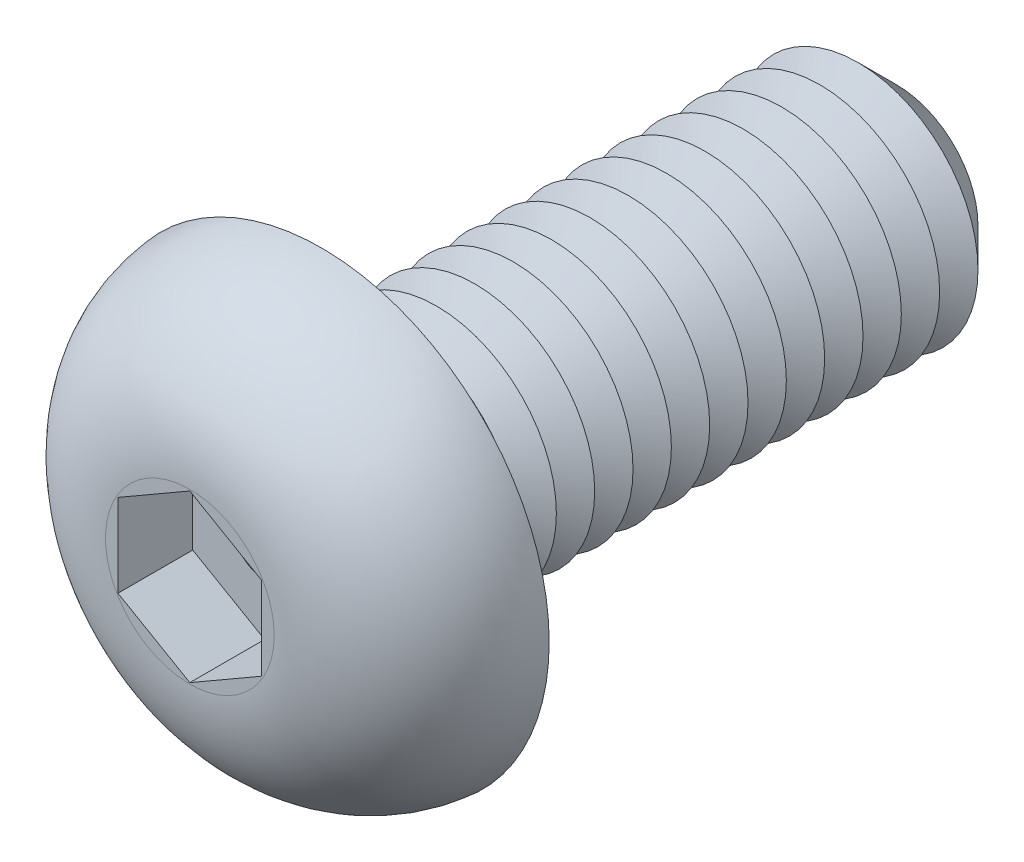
ISO-10303-21;
HEADER;
FILE_DESCRIPTION(('STEP AP214'),'2;1');
FILE_NAME('part.step','',(''),(''),'','','');
FILE_SCHEMA(('AUTOMOTIVE_DESIGN { 1 0 10303 214 1 1 1 1 }'));
ENDSEC;
DATA;
#1=APPLICATION_CONTEXT('core data for automotive mechanical design processes');
#2=APPLICATION_PROTOCOL_DEFINITION('international standard','automotive_design',2000,#1);
#3=PRODUCT_CONTEXT('',#1,'mechanical');
#4=PRODUCT('Part','Part','',(#3));
#5=PRODUCT_RELATED_PRODUCT_CATEGORY('part','',(#4));
#6=PRODUCT_DEFINITION_FORMATION('','',#4);
#7=PRODUCT_DEFINITION_CONTEXT('part definition',#1,'design');
#8=PRODUCT_DEFINITION('design','',#6,#7);
#9=PRODUCT_DEFINITION_SHAPE('','',#8);
#10=(LENGTH_UNIT() NAMED_UNIT(*) SI_UNIT(.MILLI.,.METRE.));
#11=(NAMED_UNIT(*) PLANE_ANGLE_UNIT() SI_UNIT($,.RADIAN.));
#12=(NAMED_UNIT(*) SI_UNIT($,.STERADIAN.) SOLID_ANGLE_UNIT());
#13=UNCERTAINTY_MEASURE_WITH_UNIT(LENGTH_MEASURE(1.E-05),#10,'distance_accuracy_value','');
#14=(GEOMETRIC_REPRESENTATION_CONTEXT(3) GLOBAL_UNCERTAINTY_ASSIGNED_CONTEXT((#13)) GLOBAL_UNIT_ASSIGNED_CONTEXT((#10,
#11,#12)) REPRESENTATION_CONTEXT('',''));
#15=CARTESIAN_POINT('',(0.,0.,0.));
#16=DIRECTION('',(0.,0.,1.));
#17=DIRECTION('',(1.,0.,0.));
#18=AXIS2_PLACEMENT_3D('',#15,#16,#17);
#19=CARTESIAN_POINT('',(0.,0.,-12.));
#20=DIRECTION('',(0.,0.,1.));
#21=DIRECTION('',(1.,0.,0.));
#22=AXIS2_PLACEMENT_3D('',#19,#20,#21);
#23=CYLINDRICAL_SURFACE('',#22,2.5);
#24=CARTESIAN_POINT('',(0.,0.,-0.399999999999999));
#25=DIRECTION('',(0.,0.,1.));
#26=DIRECTION('',(1.,0.,0.));
#27=AXIS2_PLACEMENT_3D('',#24,#25,#26);
#28=CIRCLE('',#27,2.5);
#29=CARTESIAN_POINT('',(2.5,0.,-0.399999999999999));
#30=VERTEX_POINT('',#29);
#31=EDGE_CURVE('E48',#30,#30,#28,.F.);
#32=ORIENTED_EDGE('',*,*,#31,.T.);
#33=EDGE_LOOP('',(#32));
#34=FACE_BOUND('',#33,.T.);
#35=CARTESIAN_POINT('',(0.,0.,-0.800000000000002));
#36=DIRECTION('',(0.,0.,1.));
#37=DIRECTION('',(1.,0.,0.));
#38=AXIS2_PLACEMENT_3D('',#35,#36,#37);
#39=CIRCLE('',#38,2.5);
#40=CARTESIAN_POINT('',(2.5,0.,-0.800000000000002));
#41=VERTEX_POINT('',#40);
#42=EDGE_CURVE('E138',#41,#41,#39,.T.);
#43=ORIENTED_EDGE('',*,*,#42,.T.);
#44=EDGE_LOOP('',(#43));
#45=FACE_BOUND('',#44,.T.);
#46=ADVANCED_FACE('F39',(#34,#45),#23,.T.);
#47=CARTESIAN_POINT('',(0.,4.75,0.));
#48=DIRECTION('',(0.,0.,1.));
#49=DIRECTION('',(1.,0.,0.));
#50=AXIS2_PLACEMENT_3D('',#47,#48,#49);
#51=PLANE('',#50);
#52=CARTESIAN_POINT('',(0.,0.,0.));
#53=DIRECTION('',(0.,0.,1.));
#54=DIRECTION('',(1.,0.,0.));
#55=AXIS2_PLACEMENT_3D('',#52,#53,#54);
#56=CIRCLE('',#55,2.9);
#57=CARTESIAN_POINT('',(2.9,0.,0.));
#58=VERTEX_POINT('',#57);
#59=EDGE_CURVE('E11',#58,#58,#56,.T.);
#60=ORIENTED_EDGE('',*,*,#59,.T.);
#61=EDGE_LOOP('',(#60));
#62=FACE_BOUND('',#61,.T.);
#63=CARTESIAN_POINT('',(0.,0.,0.));
#64=DIRECTION('',(0.,0.,1.));
#65=DIRECTION('',(1.,0.,0.));
#66=AXIS2_PLACEMENT_3D('',#63,#64,#65);
#67=CIRCLE('',#66,4.75);
#68=CARTESIAN_POINT('',(4.75,0.,0.));
#69=VERTEX_POINT('',#68);
#70=EDGE_CURVE('E157',#69,#69,#67,.T.);
#71=ORIENTED_EDGE('',*,*,#70,.F.);
#72=EDGE_LOOP('',(#71));
#73=FACE_BOUND('',#72,.T.);
#74=ADVANCED_FACE('F198',(#62,#73),#51,.F.);
#75=CARTESIAN_POINT('',(0.,0.,2.75));
#76=DIRECTION('',(0.,0.,-1.));
#77=DIRECTION('',(-1.,0.,0.));
#78=AXIS2_PLACEMENT_3D('',#75,#76,#77);
#79=PLANE('',#78);
#80=DIRECTION('',(-0.866025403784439,-0.5,0.));
#81=VECTOR('',#80,1.);
#82=CARTESIAN_POINT('',(0.,1.73205080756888,2.75));
#83=LINE('',#82,#81);
#84=CARTESIAN_POINT('',(0.,1.73205080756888,2.75));
#85=VERTEX_POINT('',#84);
#86=CARTESIAN_POINT('',(-1.5,0.866025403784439,2.75));
#87=VERTEX_POINT('',#86);
#88=EDGE_CURVE('E137',#85,#87,#83,.T.);
#89=ORIENTED_EDGE('',*,*,#88,.F.);
#90=DIRECTION('',(-0.866025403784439,0.5,0.));
#91=VECTOR('',#90,1.);
#92=CARTESIAN_POINT('',(1.5,0.86602540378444,2.75));
#93=LINE('',#92,#91);
#94=CARTESIAN_POINT('',(1.5,0.86602540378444,2.75));
#95=VERTEX_POINT('',#94);
#96=EDGE_CURVE('E55',#95,#85,#93,.T.);
#97=ORIENTED_EDGE('',*,*,#96,.F.);
#98=DIRECTION('',(0.,1.,0.));
#99=VECTOR('',#98,1.);
#100=CARTESIAN_POINT('',(1.5,-0.866025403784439,2.75));
#101=LINE('',#100,#99);
#102=CARTESIAN_POINT('',(1.5,-0.866025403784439,2.75));
#103=VERTEX_POINT('',#102);
#104=EDGE_CURVE('E151',#103,#95,#101,.T.);
#105=ORIENTED_EDGE('',*,*,#104,.F.);
#106=DIRECTION('',(0.866025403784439,0.5,0.));
#107=VECTOR('',#106,1.);
#108=CARTESIAN_POINT('',(0.,-1.73205080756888,2.75));
#109=LINE('',#108,#107);
#110=CARTESIAN_POINT('',(0.,-1.73205080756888,2.75));
#111=VERTEX_POINT('',#110);
#112=EDGE_CURVE('E148',#111,#103,#109,.T.);
#113=ORIENTED_EDGE('',*,*,#112,.F.);
#114=DIRECTION('',(0.866025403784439,-0.5,0.));
#115=VECTOR('',#114,1.);
#116=CARTESIAN_POINT('',(-1.5,-0.866025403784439,2.75));
#117=LINE('',#116,#115);
#118=CARTESIAN_POINT('',(-1.5,-0.866025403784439,2.75));
#119=VERTEX_POINT('',#118);
#120=EDGE_CURVE('E103',#119,#111,#117,.T.);
#121=ORIENTED_EDGE('',*,*,#120,.F.);
#122=DIRECTION('',(0.,-1.,0.));
#123=VECTOR('',#122,1.);
#124=CARTESIAN_POINT('',(-1.5,0.866025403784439,2.75));
#125=LINE('',#124,#123);
#126=EDGE_CURVE('E142',#87,#119,#125,.T.);
#127=ORIENTED_EDGE('',*,*,#126,.F.);
#128=EDGE_LOOP('',(#89,#97,#105,#113,#121,#127));
#129=FACE_BOUND('',#128,.T.);
#130=CARTESIAN_POINT('',(0.,0.,2.75));
#131=DIRECTION('',(0.,0.,1.));
#132=DIRECTION('',(1.,0.,0.));
#133=AXIS2_PLACEMENT_3D('',#130,#131,#132);
#134=CIRCLE('',#133,1.76043481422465);
#135=CARTESIAN_POINT('',(1.76043481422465,0.,2.75));
#136=VERTEX_POINT('',#135);
#137=EDGE_CURVE('E170',#136,#136,#134,.T.);
#138=ORIENTED_EDGE('',*,*,#137,.T.);
#139=EDGE_LOOP('',(#138));
#140=FACE_BOUND('',#139,.T.);
#141=ADVANCED_FACE('F203',(#129,#140),#79,.F.);
#142=CARTESIAN_POINT('',(0.,0.,-0.25));
#143=DIRECTION('',(0.,0.,1.));
#144=DIRECTION('',(1.,0.,0.));
#145=AXIS2_PLACEMENT_3D('',#142,#143,#144);
#146=DEGENERATE_TOROIDAL_SURFACE('',#145,1.76043481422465,3.,.T.);
#147=ORIENTED_EDGE('',*,*,#137,.F.);
#148=EDGE_LOOP('',(#147));
#149=FACE_BOUND('',#148,.T.);
#150=ORIENTED_EDGE('',*,*,#70,.T.);
#151=EDGE_LOOP('',(#150));
#152=FACE_BOUND('',#151,.T.);
#153=ADVANCED_FACE('F231',(#149,#152),#146,.T.);
#154=CARTESIAN_POINT('',(1.5,0.86602540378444,1.19));
#155=DIRECTION('',(0.5,0.866025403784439,0.));
#156=DIRECTION('',(-0.866025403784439,0.5,0.));
#157=AXIS2_PLACEMENT_3D('',#154,#155,#156);
#158=PLANE('',#157);
#159=ORIENTED_EDGE('',*,*,#96,.T.);
#160=DIRECTION('',(0.,0.,1.));
#161=VECTOR('',#160,1.);
#162=CARTESIAN_POINT('',(0.,1.73205080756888,1.19));
#163=LINE('',#162,#161);
#164=CARTESIAN_POINT('',(0.,1.73205080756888,1.19));
#165=VERTEX_POINT('',#164);
#166=EDGE_CURVE('E85',#165,#85,#163,.T.);
#167=ORIENTED_EDGE('',*,*,#166,.F.);
#168=DIRECTION('',(-0.866025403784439,0.5,0.));
#169=VECTOR('',#168,1.);
#170=CARTESIAN_POINT('',(1.5,0.86602540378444,1.19));
#171=LINE('',#170,#169);
#172=CARTESIAN_POINT('',(1.5,0.86602540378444,1.19));
#173=VERTEX_POINT('',#172);
#174=EDGE_CURVE('E154',#173,#165,#171,.T.);
#175=ORIENTED_EDGE('',*,*,#174,.F.);
#176=DIRECTION('',(0.,0.,1.));
#177=VECTOR('',#176,1.);
#178=CARTESIAN_POINT('',(1.5,0.86602540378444,1.19));
#179=LINE('',#178,#177);
#180=EDGE_CURVE('E63',#173,#95,#179,.T.);
#181=ORIENTED_EDGE('',*,*,#180,.T.);
#182=EDGE_LOOP('',(#159,#167,#175,#181));
#183=FACE_BOUND('',#182,.T.);
#184=ADVANCED_FACE('F217',(#183),#158,.F.);
#185=CARTESIAN_POINT('',(1.5,-0.866025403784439,1.19));
#186=DIRECTION('',(1.,0.,0.));
#187=DIRECTION('',(0.,1.,0.));
#188=AXIS2_PLACEMENT_3D('',#185,#186,#187);
#189=PLANE('',#188);
#190=ORIENTED_EDGE('',*,*,#104,.T.);
#191=ORIENTED_EDGE('',*,*,#180,.F.);
#192=DIRECTION('',(0.,1.,0.));
#193=VECTOR('',#192,1.);
#194=CARTESIAN_POINT('',(1.5,-0.866025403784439,1.19));
#195=LINE('',#194,#193);
#196=CARTESIAN_POINT('',(1.5,-0.866025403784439,1.19));
#197=VERTEX_POINT('',#196);
#198=EDGE_CURVE('E117',#197,#173,#195,.T.);
#199=ORIENTED_EDGE('',*,*,#198,.F.);
#200=DIRECTION('',(0.,0.,1.));
#201=VECTOR('',#200,1.);
#202=CARTESIAN_POINT('',(1.5,-0.866025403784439,1.19));
#203=LINE('',#202,#201);
#204=EDGE_CURVE('E108',#197,#103,#203,.T.);
#205=ORIENTED_EDGE('',*,*,#204,.T.);
#206=EDGE_LOOP('',(#190,#191,#199,#205));
#207=FACE_BOUND('',#206,.T.);
#208=ADVANCED_FACE('F214',(#207),#189,.F.);
#209=CARTESIAN_POINT('',(0.,-1.73205080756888,1.19));
#210=DIRECTION('',(0.5,-0.866025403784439,0.));
#211=DIRECTION('',(0.866025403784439,0.5,0.));
#212=AXIS2_PLACEMENT_3D('',#209,#210,#211);
#213=PLANE('',#212);
#214=ORIENTED_EDGE('',*,*,#112,.T.);
#215=ORIENTED_EDGE('',*,*,#204,.F.);
#216=DIRECTION('',(0.866025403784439,0.5,0.));
#217=VECTOR('',#216,1.);
#218=CARTESIAN_POINT('',(0.,-1.73205080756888,1.19));
#219=LINE('',#218,#217);
#220=CARTESIAN_POINT('',(0.,-1.73205080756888,1.19));
#221=VERTEX_POINT('',#220);
#222=EDGE_CURVE('E112',#221,#197,#219,.T.);
#223=ORIENTED_EDGE('',*,*,#222,.F.);
#224=DIRECTION('',(0.,0.,1.));
#225=VECTOR('',#224,1.);
#226=CARTESIAN_POINT('',(0.,-1.73205080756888,1.19));
#227=LINE('',#226,#225);
#228=EDGE_CURVE('E96',#221,#111,#227,.T.);
#229=ORIENTED_EDGE('',*,*,#228,.T.);
#230=EDGE_LOOP('',(#214,#215,#223,#229));
#231=FACE_BOUND('',#230,.T.);
#232=ADVANCED_FACE('F113',(#231),#213,.F.);
#233=CARTESIAN_POINT('',(-1.5,-0.866025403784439,1.19));
#234=DIRECTION('',(-0.5,-0.866025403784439,0.));
#235=DIRECTION('',(0.866025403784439,-0.5,0.));
#236=AXIS2_PLACEMENT_3D('',#233,#234,#235);
#237=PLANE('',#236);
#238=ORIENTED_EDGE('',*,*,#120,.T.);
#239=ORIENTED_EDGE('',*,*,#228,.F.);
#240=DIRECTION('',(0.866025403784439,-0.5,0.));
#241=VECTOR('',#240,1.);
#242=CARTESIAN_POINT('',(-1.5,-0.866025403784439,1.19));
#243=LINE('',#242,#241);
#244=CARTESIAN_POINT('',(-1.5,-0.866025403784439,1.19));
#245=VERTEX_POINT('',#244);
#246=EDGE_CURVE('E100',#245,#221,#243,.T.);
#247=ORIENTED_EDGE('',*,*,#246,.F.);
#248=DIRECTION('',(0.,0.,1.));
#249=VECTOR('',#248,1.);
#250=CARTESIAN_POINT('',(-1.5,-0.866025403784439,1.19));
#251=LINE('',#250,#249);
#252=EDGE_CURVE('E109',#245,#119,#251,.T.);
#253=ORIENTED_EDGE('',*,*,#252,.T.);
#254=EDGE_LOOP('',(#238,#239,#247,#253));
#255=FACE_BOUND('',#254,.T.);
#256=ADVANCED_FACE('F98',(#255),#237,.F.);
#257=CARTESIAN_POINT('',(-1.5,0.866025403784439,1.19));
#258=DIRECTION('',(-1.,0.,0.));
#259=DIRECTION('',(0.,-1.,0.));
#260=AXIS2_PLACEMENT_3D('',#257,#258,#259);
#261=PLANE('',#260);
#262=ORIENTED_EDGE('',*,*,#126,.T.);
#263=ORIENTED_EDGE('',*,*,#252,.F.);
#264=DIRECTION('',(0.,-1.,0.));
#265=VECTOR('',#264,1.);
#266=CARTESIAN_POINT('',(-1.5,0.866025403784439,1.19));
#267=LINE('',#266,#265);
#268=CARTESIAN_POINT('',(-1.5,0.866025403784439,1.19));
#269=VERTEX_POINT('',#268);
#270=EDGE_CURVE('E123',#269,#245,#267,.T.);
#271=ORIENTED_EDGE('',*,*,#270,.F.);
#272=DIRECTION('',(0.,0.,1.));
#273=VECTOR('',#272,1.);
#274=CARTESIAN_POINT('',(-1.5,0.866025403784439,1.19));
#275=LINE('',#274,#273);
#276=EDGE_CURVE('E162',#269,#87,#275,.T.);
#277=ORIENTED_EDGE('',*,*,#276,.T.);
#278=EDGE_LOOP('',(#262,#263,#271,#277));
#279=FACE_BOUND('',#278,.T.);
#280=ADVANCED_FACE('F222',(#279),#261,.F.);
#281=CARTESIAN_POINT('',(0.,1.73205080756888,1.19));
#282=DIRECTION('',(-0.5,0.866025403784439,0.));
#283=DIRECTION('',(-0.866025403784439,-0.5,0.));
#284=AXIS2_PLACEMENT_3D('',#281,#282,#283);
#285=PLANE('',#284);
#286=ORIENTED_EDGE('',*,*,#88,.T.);
#287=ORIENTED_EDGE('',*,*,#276,.F.);
#288=DIRECTION('',(-0.866025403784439,-0.5,0.));
#289=VECTOR('',#288,1.);
#290=CARTESIAN_POINT('',(0.,1.73205080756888,1.19));
#291=LINE('',#290,#289);
#292=EDGE_CURVE('E129',#165,#269,#291,.T.);
#293=ORIENTED_EDGE('',*,*,#292,.F.);
#294=ORIENTED_EDGE('',*,*,#166,.T.);
#295=EDGE_LOOP('',(#286,#287,#293,#294));
#296=FACE_BOUND('',#295,.T.);
#297=ADVANCED_FACE('F212',(#296),#285,.F.);
#298=CARTESIAN_POINT('',(0.,0.,1.19));
#299=DIRECTION('',(0.,0.,1.));
#300=DIRECTION('',(1.,0.,0.));
#301=AXIS2_PLACEMENT_3D('',#298,#299,#300);
#302=PLANE('',#301);
#303=CARTESIAN_POINT('',(0.,0.,1.19));
#304=DIRECTION('',(0.,0.,1.));
#305=DIRECTION('',(1.,0.,0.));
#306=AXIS2_PLACEMENT_3D('',#303,#304,#305);
#307=CIRCLE('',#306,0.65);
#308=CARTESIAN_POINT('',(0.65,0.,1.19));
#309=VERTEX_POINT('',#308);
#310=EDGE_CURVE('E359',#309,#309,#307,.T.);
#311=ORIENTED_EDGE('',*,*,#310,.F.);
#312=EDGE_LOOP('',(#311));
#313=FACE_BOUND('',#312,.T.);
#314=ORIENTED_EDGE('',*,*,#174,.T.);
#315=ORIENTED_EDGE('',*,*,#292,.T.);
#316=ORIENTED_EDGE('',*,*,#270,.T.);
#317=ORIENTED_EDGE('',*,*,#246,.T.);
#318=ORIENTED_EDGE('',*,*,#222,.T.);
#319=ORIENTED_EDGE('',*,*,#198,.T.);
#320=EDGE_LOOP('',(#314,#315,#316,#317,#318,#319));
#321=FACE_BOUND('',#320,.T.);
#322=ADVANCED_FACE('F120',(#313,#321),#302,.T.);
#323=CARTESIAN_POINT('',(0.,0.,-0.800000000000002));
#324=DIRECTION('',(0.,0.,1.));
#325=DIRECTION('',(1.,0.,0.));
#326=AXIS2_PLACEMENT_3D('',#323,#324,#325);
#327=CONICAL_SURFACE('',#326,2.5,1.0471975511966);
#328=CARTESIAN_POINT('',(0.,0.,-1.2));
#329=DIRECTION('',(0.,0.,1.));
#330=DIRECTION('',(1.,0.,0.));
#331=AXIS2_PLACEMENT_3D('',#328,#329,#330);
#332=CIRCLE('',#331,1.80717967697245);
#333=CARTESIAN_POINT('',(1.80717967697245,0.,-1.2));
#334=VERTEX_POINT('',#333);
#335=EDGE_CURVE('E256',#334,#334,#332,.T.);
#336=ORIENTED_EDGE('',*,*,#335,.T.);
#337=EDGE_LOOP('',(#336));
#338=FACE_BOUND('',#337,.T.);
#339=ORIENTED_EDGE('',*,*,#42,.F.);
#340=EDGE_LOOP('',(#339));
#341=FACE_BOUND('',#340,.T.);
#342=ADVANCED_FACE('F211',(#338,#341),#327,.T.);
#343=CARTESIAN_POINT('',(0.,0.,-1.2));
#344=DIRECTION('',(0.,0.,-1.));
#345=DIRECTION('',(-1.,0.,0.));
#346=AXIS2_PLACEMENT_3D('',#343,#344,#345);
#347=CONICAL_SURFACE('',#346,1.80717967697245,1.0471975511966);
#348=CARTESIAN_POINT('',(0.,0.,-1.6));
#349=DIRECTION('',(0.,0.,1.));
#350=DIRECTION('',(1.,0.,0.));
#351=AXIS2_PLACEMENT_3D('',#348,#349,#350);
#352=CIRCLE('',#351,2.5);
#353=CARTESIAN_POINT('',(2.5,0.,-1.6));
#354=VERTEX_POINT('',#353);
#355=EDGE_CURVE('E260',#354,#354,#352,.T.);
#356=ORIENTED_EDGE('',*,*,#355,.T.);
#357=EDGE_LOOP('',(#356));
#358=FACE_BOUND('',#357,.T.);
#359=ORIENTED_EDGE('',*,*,#335,.F.);
#360=EDGE_LOOP('',(#359));
#361=FACE_BOUND('',#360,.T.);
#362=ADVANCED_FACE('F471',(#358,#361),#347,.T.);
#363=CARTESIAN_POINT('',(0.,0.,-1.6));
#364=DIRECTION('',(0.,0.,1.));
#365=DIRECTION('',(1.,0.,0.));
#366=AXIS2_PLACEMENT_3D('',#363,#364,#365);
#367=CONICAL_SURFACE('',#366,2.5,1.0471975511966);
#368=CARTESIAN_POINT('',(0.,0.,-2.));
#369=DIRECTION('',(0.,0.,1.));
#370=DIRECTION('',(1.,0.,0.));
#371=AXIS2_PLACEMENT_3D('',#368,#369,#370);
#372=CIRCLE('',#371,1.80717967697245);
#373=CARTESIAN_POINT('',(1.80717967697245,0.,-2.));
#374=VERTEX_POINT('',#373);
#375=EDGE_CURVE('E264',#374,#374,#372,.T.);
#376=ORIENTED_EDGE('',*,*,#375,.T.);
#377=EDGE_LOOP('',(#376));
#378=FACE_BOUND('',#377,.T.);
#379=ORIENTED_EDGE('',*,*,#355,.F.);
#380=EDGE_LOOP('',(#379));
#381=FACE_BOUND('',#380,.T.);
#382=ADVANCED_FACE('F467',(#378,#381),#367,.T.);
#383=CARTESIAN_POINT('',(0.,0.,-2.));
#384=DIRECTION('',(0.,0.,-1.));
#385=DIRECTION('',(-1.,0.,0.));
#386=AXIS2_PLACEMENT_3D('',#383,#384,#385);
#387=CONICAL_SURFACE('',#386,1.80717967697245,1.0471975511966);
#388=CARTESIAN_POINT('',(0.,0.,-2.4));
#389=DIRECTION('',(0.,0.,1.));
#390=DIRECTION('',(1.,0.,0.));
#391=AXIS2_PLACEMENT_3D('',#388,#389,#390);
#392=CIRCLE('',#391,2.5);
#393=CARTESIAN_POINT('',(2.5,0.,-2.4));
#394=VERTEX_POINT('',#393);
#395=EDGE_CURVE('E268',#394,#394,#392,.T.);
#396=ORIENTED_EDGE('',*,*,#395,.T.);
#397=EDGE_LOOP('',(#396));
#398=FACE_BOUND('',#397,.T.);
#399=ORIENTED_EDGE('',*,*,#375,.F.);
#400=EDGE_LOOP('',(#399));
#401=FACE_BOUND('',#400,.T.);
#402=ADVANCED_FACE('F463',(#398,#401),#387,.T.);
#403=CARTESIAN_POINT('',(0.,0.,-2.4));
#404=DIRECTION('',(0.,0.,1.));
#405=DIRECTION('',(1.,0.,0.));
#406=AXIS2_PLACEMENT_3D('',#403,#404,#405);
#407=CONICAL_SURFACE('',#406,2.5,1.0471975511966);
#408=CARTESIAN_POINT('',(0.,0.,-2.8));
#409=DIRECTION('',(0.,0.,1.));
#410=DIRECTION('',(1.,0.,0.));
#411=AXIS2_PLACEMENT_3D('',#408,#409,#410);
#412=CIRCLE('',#411,1.80717967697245);
#413=CARTESIAN_POINT('',(1.80717967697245,0.,-2.8));
#414=VERTEX_POINT('',#413);
#415=EDGE_CURVE('E272',#414,#414,#412,.T.);
#416=ORIENTED_EDGE('',*,*,#415,.T.);
#417=EDGE_LOOP('',(#416));
#418=FACE_BOUND('',#417,.T.);
#419=ORIENTED_EDGE('',*,*,#395,.F.);
#420=EDGE_LOOP('',(#419));
#421=FACE_BOUND('',#420,.T.);
#422=ADVANCED_FACE('F459',(#418,#421),#407,.T.);
#423=CARTESIAN_POINT('',(0.,0.,-2.8));
#424=DIRECTION('',(0.,0.,-1.));
#425=DIRECTION('',(-1.,0.,0.));
#426=AXIS2_PLACEMENT_3D('',#423,#424,#425);
#427=CONICAL_SURFACE('',#426,1.80717967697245,1.0471975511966);
#428=CARTESIAN_POINT('',(0.,0.,-3.2));
#429=DIRECTION('',(0.,0.,1.));
#430=DIRECTION('',(1.,0.,0.));
#431=AXIS2_PLACEMENT_3D('',#428,#429,#430);
#432=CIRCLE('',#431,2.5);
#433=CARTESIAN_POINT('',(2.5,0.,-3.2));
#434=VERTEX_POINT('',#433);
#435=EDGE_CURVE('E276',#434,#434,#432,.T.);
#436=ORIENTED_EDGE('',*,*,#435,.T.);
#437=EDGE_LOOP('',(#436));
#438=FACE_BOUND('',#437,.T.);
#439=ORIENTED_EDGE('',*,*,#415,.F.);
#440=EDGE_LOOP('',(#439));
#441=FACE_BOUND('',#440,.T.);
#442=ADVANCED_FACE('F455',(#438,#441),#427,.T.);
#443=CARTESIAN_POINT('',(0.,0.,-3.2));
#444=DIRECTION('',(0.,0.,1.));
#445=DIRECTION('',(1.,0.,0.));
#446=AXIS2_PLACEMENT_3D('',#443,#444,#445);
#447=CONICAL_SURFACE('',#446,2.5,1.0471975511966);
#448=CARTESIAN_POINT('',(0.,0.,-3.6));
#449=DIRECTION('',(0.,0.,1.));
#450=DIRECTION('',(1.,0.,0.));
#451=AXIS2_PLACEMENT_3D('',#448,#449,#450);
#452=CIRCLE('',#451,1.80717967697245);
#453=CARTESIAN_POINT('',(1.80717967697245,0.,-3.6));
#454=VERTEX_POINT('',#453);
#455=EDGE_CURVE('E279',#454,#454,#452,.T.);
#456=ORIENTED_EDGE('',*,*,#455,.T.);
#457=EDGE_LOOP('',(#456));
#458=FACE_BOUND('',#457,.T.);
#459=ORIENTED_EDGE('',*,*,#435,.F.);
#460=EDGE_LOOP('',(#459));
#461=FACE_BOUND('',#460,.T.);
#462=ADVANCED_FACE('F451',(#458,#461),#447,.T.);
#463=CARTESIAN_POINT('',(0.,0.,-3.6));
#464=DIRECTION('',(0.,0.,-1.));
#465=DIRECTION('',(-1.,0.,0.));
#466=AXIS2_PLACEMENT_3D('',#463,#464,#465);
#467=CONICAL_SURFACE('',#466,1.80717967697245,1.0471975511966);
#468=CARTESIAN_POINT('',(0.,0.,-4.));
#469=DIRECTION('',(0.,0.,1.));
#470=DIRECTION('',(1.,0.,0.));
#471=AXIS2_PLACEMENT_3D('',#468,#469,#470);
#472=CIRCLE('',#471,2.5);
#473=CARTESIAN_POINT('',(2.5,0.,-4.));
#474=VERTEX_POINT('',#473);
#475=EDGE_CURVE('E283',#474,#474,#472,.T.);
#476=ORIENTED_EDGE('',*,*,#475,.T.);
#477=EDGE_LOOP('',(#476));
#478=FACE_BOUND('',#477,.T.);
#479=ORIENTED_EDGE('',*,*,#455,.F.);
#480=EDGE_LOOP('',(#479));
#481=FACE_BOUND('',#480,.T.);
#482=ADVANCED_FACE('F447',(#478,#481),#467,.T.);
#483=CARTESIAN_POINT('',(0.,0.,-4.));
#484=DIRECTION('',(0.,0.,1.));
#485=DIRECTION('',(1.,0.,0.));
#486=AXIS2_PLACEMENT_3D('',#483,#484,#485);
#487=CONICAL_SURFACE('',#486,2.5,1.0471975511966);
#488=CARTESIAN_POINT('',(0.,0.,-4.4));
#489=DIRECTION('',(0.,0.,1.));
#490=DIRECTION('',(1.,0.,0.));
#491=AXIS2_PLACEMENT_3D('',#488,#489,#490);
#492=CIRCLE('',#491,1.80717967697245);
#493=CARTESIAN_POINT('',(1.80717967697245,0.,-4.4));
#494=VERTEX_POINT('',#493);
#495=EDGE_CURVE('E286',#494,#494,#492,.T.);
#496=ORIENTED_EDGE('',*,*,#495,.T.);
#497=EDGE_LOOP('',(#496));
#498=FACE_BOUND('',#497,.T.);
#499=ORIENTED_EDGE('',*,*,#475,.F.);
#500=EDGE_LOOP('',(#499));
#501=FACE_BOUND('',#500,.T.);
#502=ADVANCED_FACE('F443',(#498,#501),#487,.T.);
#503=CARTESIAN_POINT('',(0.,0.,-4.4));
#504=DIRECTION('',(0.,0.,-1.));
#505=DIRECTION('',(-1.,0.,0.));
#506=AXIS2_PLACEMENT_3D('',#503,#504,#505);
#507=CONICAL_SURFACE('',#506,1.80717967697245,1.0471975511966);
#508=CARTESIAN_POINT('',(0.,0.,-4.8));
#509=DIRECTION('',(0.,0.,1.));
#510=DIRECTION('',(1.,0.,0.));
#511=AXIS2_PLACEMENT_3D('',#508,#509,#510);
#512=CIRCLE('',#511,2.5);
#513=CARTESIAN_POINT('',(2.5,0.,-4.8));
#514=VERTEX_POINT('',#513);
#515=EDGE_CURVE('E289',#514,#514,#512,.T.);
#516=ORIENTED_EDGE('',*,*,#515,.T.);
#517=EDGE_LOOP('',(#516));
#518=FACE_BOUND('',#517,.T.);
#519=ORIENTED_EDGE('',*,*,#495,.F.);
#520=EDGE_LOOP('',(#519));
#521=FACE_BOUND('',#520,.T.);
#522=ADVANCED_FACE('F439',(#518,#521),#507,.T.);
#523=CARTESIAN_POINT('',(0.,0.,-4.8));
#524=DIRECTION('',(0.,0.,1.));
#525=DIRECTION('',(1.,0.,0.));
#526=AXIS2_PLACEMENT_3D('',#523,#524,#525);
#527=CONICAL_SURFACE('',#526,2.5,1.0471975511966);
#528=CARTESIAN_POINT('',(0.,0.,-5.2));
#529=DIRECTION('',(0.,0.,1.));
#530=DIRECTION('',(1.,0.,0.));
#531=AXIS2_PLACEMENT_3D('',#528,#529,#530);
#532=CIRCLE('',#531,1.80717967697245);
#533=CARTESIAN_POINT('',(1.80717967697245,0.,-5.2));
#534=VERTEX_POINT('',#533);
#535=EDGE_CURVE('E293',#534,#534,#532,.T.);
#536=ORIENTED_EDGE('',*,*,#535,.T.);
#537=EDGE_LOOP('',(#536));
#538=FACE_BOUND('',#537,.T.);
#539=ORIENTED_EDGE('',*,*,#515,.F.);
#540=EDGE_LOOP('',(#539));
#541=FACE_BOUND('',#540,.T.);
#542=ADVANCED_FACE('F435',(#538,#541),#527,.T.);
#543=CARTESIAN_POINT('',(0.,0.,-5.2));
#544=DIRECTION('',(0.,0.,-1.));
#545=DIRECTION('',(-1.,0.,0.));
#546=AXIS2_PLACEMENT_3D('',#543,#544,#545);
#547=CONICAL_SURFACE('',#546,1.80717967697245,1.0471975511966);
#548=CARTESIAN_POINT('',(0.,0.,-5.6));
#549=DIRECTION('',(0.,0.,1.));
#550=DIRECTION('',(1.,0.,0.));
#551=AXIS2_PLACEMENT_3D('',#548,#549,#550);
#552=CIRCLE('',#551,2.5);
#553=CARTESIAN_POINT('',(2.5,0.,-5.6));
#554=VERTEX_POINT('',#553);
#555=EDGE_CURVE('E297',#554,#554,#552,.T.);
#556=ORIENTED_EDGE('',*,*,#555,.T.);
#557=EDGE_LOOP('',(#556));
#558=FACE_BOUND('',#557,.T.);
#559=ORIENTED_EDGE('',*,*,#535,.F.);
#560=EDGE_LOOP('',(#559));
#561=FACE_BOUND('',#560,.T.);
#562=ADVANCED_FACE('F431',(#558,#561),#547,.T.);
#563=CARTESIAN_POINT('',(0.,0.,-5.6));
#564=DIRECTION('',(0.,0.,1.));
#565=DIRECTION('',(1.,0.,0.));
#566=AXIS2_PLACEMENT_3D('',#563,#564,#565);
#567=CONICAL_SURFACE('',#566,2.5,1.0471975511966);
#568=CARTESIAN_POINT('',(0.,0.,-6.));
#569=DIRECTION('',(0.,0.,1.));
#570=DIRECTION('',(1.,0.,0.));
#571=AXIS2_PLACEMENT_3D('',#568,#569,#570);
#572=CIRCLE('',#571,1.80717967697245);
#573=CARTESIAN_POINT('',(1.80717967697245,0.,-6.));
#574=VERTEX_POINT('',#573);
#575=EDGE_CURVE('E301',#574,#574,#572,.T.);
#576=ORIENTED_EDGE('',*,*,#575,.T.);
#577=EDGE_LOOP('',(#576));
#578=FACE_BOUND('',#577,.T.);
#579=ORIENTED_EDGE('',*,*,#555,.F.);
#580=EDGE_LOOP('',(#579));
#581=FACE_BOUND('',#580,.T.);
#582=ADVANCED_FACE('F427',(#578,#581),#567,.T.);
#583=CARTESIAN_POINT('',(0.,0.,-6.));
#584=DIRECTION('',(0.,0.,-1.));
#585=DIRECTION('',(-1.,0.,0.));
#586=AXIS2_PLACEMENT_3D('',#583,#584,#585);
#587=CONICAL_SURFACE('',#586,1.80717967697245,1.0471975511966);
#588=CARTESIAN_POINT('',(0.,0.,-6.4));
#589=DIRECTION('',(0.,0.,1.));
#590=DIRECTION('',(1.,0.,0.));
#591=AXIS2_PLACEMENT_3D('',#588,#589,#590);
#592=CIRCLE('',#591,2.5);
#593=CARTESIAN_POINT('',(2.5,0.,-6.4));
#594=VERTEX_POINT('',#593);
#595=EDGE_CURVE('E305',#594,#594,#592,.T.);
#596=ORIENTED_EDGE('',*,*,#595,.T.);
#597=EDGE_LOOP('',(#596));
#598=FACE_BOUND('',#597,.T.);
#599=ORIENTED_EDGE('',*,*,#575,.F.);
#600=EDGE_LOOP('',(#599));
#601=FACE_BOUND('',#600,.T.);
#602=ADVANCED_FACE('F423',(#598,#601),#587,.T.);
#603=CARTESIAN_POINT('',(0.,0.,-6.4));
#604=DIRECTION('',(0.,0.,1.));
#605=DIRECTION('',(1.,0.,0.));
#606=AXIS2_PLACEMENT_3D('',#603,#604,#605);
#607=CONICAL_SURFACE('',#606,2.5,1.0471975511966);
#608=CARTESIAN_POINT('',(0.,0.,-6.8));
#609=DIRECTION('',(0.,0.,1.));
#610=DIRECTION('',(1.,0.,0.));
#611=AXIS2_PLACEMENT_3D('',#608,#609,#610);
#612=CIRCLE('',#611,1.80717967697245);
#613=CARTESIAN_POINT('',(1.80717967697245,0.,-6.8));
#614=VERTEX_POINT('',#613);
#615=EDGE_CURVE('E309',#614,#614,#612,.T.);
#616=ORIENTED_EDGE('',*,*,#615,.T.);
#617=EDGE_LOOP('',(#616));
#618=FACE_BOUND('',#617,.T.);
#619=ORIENTED_EDGE('',*,*,#595,.F.);
#620=EDGE_LOOP('',(#619));
#621=FACE_BOUND('',#620,.T.);
#622=ADVANCED_FACE('F419',(#618,#621),#607,.T.);
#623=CARTESIAN_POINT('',(0.,0.,-6.8));
#624=DIRECTION('',(0.,0.,-1.));
#625=DIRECTION('',(-1.,0.,0.));
#626=AXIS2_PLACEMENT_3D('',#623,#624,#625);
#627=CONICAL_SURFACE('',#626,1.80717967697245,1.0471975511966);
#628=CARTESIAN_POINT('',(0.,0.,-7.2));
#629=DIRECTION('',(0.,0.,1.));
#630=DIRECTION('',(1.,0.,0.));
#631=AXIS2_PLACEMENT_3D('',#628,#629,#630);
#632=CIRCLE('',#631,2.5);
#633=CARTESIAN_POINT('',(2.5,0.,-7.2));
#634=VERTEX_POINT('',#633);
#635=EDGE_CURVE('E313',#634,#634,#632,.T.);
#636=ORIENTED_EDGE('',*,*,#635,.T.);
#637=EDGE_LOOP('',(#636));
#638=FACE_BOUND('',#637,.T.);
#639=ORIENTED_EDGE('',*,*,#615,.F.);
#640=EDGE_LOOP('',(#639));
#641=FACE_BOUND('',#640,.T.);
#642=ADVANCED_FACE('F415',(#638,#641),#627,.T.);
#643=CARTESIAN_POINT('',(0.,0.,-7.2));
#644=DIRECTION('',(0.,0.,1.));
#645=DIRECTION('',(1.,0.,0.));
#646=AXIS2_PLACEMENT_3D('',#643,#644,#645);
#647=CONICAL_SURFACE('',#646,2.5,1.0471975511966);
#648=CARTESIAN_POINT('',(0.,0.,-7.6));
#649=DIRECTION('',(0.,0.,1.));
#650=DIRECTION('',(1.,0.,0.));
#651=AXIS2_PLACEMENT_3D('',#648,#649,#650);
#652=CIRCLE('',#651,1.80717967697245);
#653=CARTESIAN_POINT('',(1.80717967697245,0.,-7.6));
#654=VERTEX_POINT('',#653);
#655=EDGE_CURVE('E317',#654,#654,#652,.T.);
#656=ORIENTED_EDGE('',*,*,#655,.T.);
#657=EDGE_LOOP('',(#656));
#658=FACE_BOUND('',#657,.T.);
#659=ORIENTED_EDGE('',*,*,#635,.F.);
#660=EDGE_LOOP('',(#659));
#661=FACE_BOUND('',#660,.T.);
#662=ADVANCED_FACE('F411',(#658,#661),#647,.T.);
#663=CARTESIAN_POINT('',(0.,0.,-7.6));
#664=DIRECTION('',(0.,0.,-1.));
#665=DIRECTION('',(-1.,0.,0.));
#666=AXIS2_PLACEMENT_3D('',#663,#664,#665);
#667=CONICAL_SURFACE('',#666,1.80717967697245,1.0471975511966);
#668=CARTESIAN_POINT('',(0.,0.,-8.));
#669=DIRECTION('',(0.,0.,1.));
#670=DIRECTION('',(1.,0.,0.));
#671=AXIS2_PLACEMENT_3D('',#668,#669,#670);
#672=CIRCLE('',#671,2.5);
#673=CARTESIAN_POINT('',(2.5,0.,-8.));
#674=VERTEX_POINT('',#673);
#675=EDGE_CURVE('E321',#674,#674,#672,.T.);
#676=ORIENTED_EDGE('',*,*,#675,.T.);
#677=EDGE_LOOP('',(#676));
#678=FACE_BOUND('',#677,.T.);
#679=ORIENTED_EDGE('',*,*,#655,.F.);
#680=EDGE_LOOP('',(#679));
#681=FACE_BOUND('',#680,.T.);
#682=ADVANCED_FACE('F407',(#678,#681),#667,.T.);
#683=CARTESIAN_POINT('',(0.,0.,-8.));
#684=DIRECTION('',(0.,0.,1.));
#685=DIRECTION('',(1.,0.,0.));
#686=AXIS2_PLACEMENT_3D('',#683,#684,#685);
#687=CONICAL_SURFACE('',#686,2.5,1.0471975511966);
#688=CARTESIAN_POINT('',(0.,0.,-8.4));
#689=DIRECTION('',(0.,0.,1.));
#690=DIRECTION('',(1.,0.,0.));
#691=AXIS2_PLACEMENT_3D('',#688,#689,#690);
#692=CIRCLE('',#691,1.80717967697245);
#693=CARTESIAN_POINT('',(1.80717967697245,0.,-8.4));
#694=VERTEX_POINT('',#693);
#695=EDGE_CURVE('E325',#694,#694,#692,.T.);
#696=ORIENTED_EDGE('',*,*,#695,.T.);
#697=EDGE_LOOP('',(#696));
#698=FACE_BOUND('',#697,.T.);
#699=ORIENTED_EDGE('',*,*,#675,.F.);
#700=EDGE_LOOP('',(#699));
#701=FACE_BOUND('',#700,.T.);
#702=ADVANCED_FACE('F403',(#698,#701),#687,.T.);
#703=CARTESIAN_POINT('',(0.,0.,-8.4));
#704=DIRECTION('',(0.,0.,-1.));
#705=DIRECTION('',(-1.,0.,0.));
#706=AXIS2_PLACEMENT_3D('',#703,#704,#705);
#707=CONICAL_SURFACE('',#706,1.80717967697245,1.0471975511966);
#708=CARTESIAN_POINT('',(0.,0.,-8.8));
#709=DIRECTION('',(0.,0.,1.));
#710=DIRECTION('',(1.,0.,0.));
#711=AXIS2_PLACEMENT_3D('',#708,#709,#710);
#712=CIRCLE('',#711,2.5);
#713=CARTESIAN_POINT('',(2.5,0.,-8.8));
#714=VERTEX_POINT('',#713);
#715=EDGE_CURVE('E329',#714,#714,#712,.T.);
#716=ORIENTED_EDGE('',*,*,#715,.T.);
#717=EDGE_LOOP('',(#716));
#718=FACE_BOUND('',#717,.T.);
#719=ORIENTED_EDGE('',*,*,#695,.F.);
#720=EDGE_LOOP('',(#719));
#721=FACE_BOUND('',#720,.T.);
#722=ADVANCED_FACE('F399',(#718,#721),#707,.T.);
#723=CARTESIAN_POINT('',(0.,0.,-8.8));
#724=DIRECTION('',(0.,0.,1.));
#725=DIRECTION('',(1.,0.,0.));
#726=AXIS2_PLACEMENT_3D('',#723,#724,#725);
#727=CONICAL_SURFACE('',#726,2.5,1.0471975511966);
#728=CARTESIAN_POINT('',(0.,0.,-9.2));
#729=DIRECTION('',(0.,0.,1.));
#730=DIRECTION('',(1.,0.,0.));
#731=AXIS2_PLACEMENT_3D('',#728,#729,#730);
#732=CIRCLE('',#731,1.80717967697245);
#733=CARTESIAN_POINT('',(1.80717967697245,0.,-9.2));
#734=VERTEX_POINT('',#733);
#735=EDGE_CURVE('E332',#734,#734,#732,.T.);
#736=ORIENTED_EDGE('',*,*,#735,.T.);
#737=EDGE_LOOP('',(#736));
#738=FACE_BOUND('',#737,.T.);
#739=ORIENTED_EDGE('',*,*,#715,.F.);
#740=EDGE_LOOP('',(#739));
#741=FACE_BOUND('',#740,.T.);
#742=ADVANCED_FACE('F395',(#738,#741),#727,.T.);
#743=CARTESIAN_POINT('',(0.,0.,-9.2));
#744=DIRECTION('',(0.,0.,-1.));
#745=DIRECTION('',(-1.,0.,0.));
#746=AXIS2_PLACEMENT_3D('',#743,#744,#745);
#747=CONICAL_SURFACE('',#746,1.80717967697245,1.0471975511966);
#748=CARTESIAN_POINT('',(0.,0.,-9.6));
#749=DIRECTION('',(0.,0.,1.));
#750=DIRECTION('',(1.,0.,0.));
#751=AXIS2_PLACEMENT_3D('',#748,#749,#750);
#752=CIRCLE('',#751,2.5);
#753=CARTESIAN_POINT('',(2.5,0.,-9.6));
#754=VERTEX_POINT('',#753);
#755=EDGE_CURVE('E336',#754,#754,#752,.T.);
#756=ORIENTED_EDGE('',*,*,#755,.T.);
#757=EDGE_LOOP('',(#756));
#758=FACE_BOUND('',#757,.T.);
#759=ORIENTED_EDGE('',*,*,#735,.F.);
#760=EDGE_LOOP('',(#759));
#761=FACE_BOUND('',#760,.T.);
#762=ADVANCED_FACE('F391',(#758,#761),#747,.T.);
#763=CARTESIAN_POINT('',(0.,0.,-9.6));
#764=DIRECTION('',(0.,0.,1.));
#765=DIRECTION('',(1.,0.,0.));
#766=AXIS2_PLACEMENT_3D('',#763,#764,#765);
#767=CONICAL_SURFACE('',#766,2.5,1.0471975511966);
#768=CARTESIAN_POINT('',(0.,0.,-10.));
#769=DIRECTION('',(0.,0.,1.));
#770=DIRECTION('',(1.,0.,0.));
#771=AXIS2_PLACEMENT_3D('',#768,#769,#770);
#772=CIRCLE('',#771,1.80717967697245);
#773=CARTESIAN_POINT('',(1.80717967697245,0.,-10.));
#774=VERTEX_POINT('',#773);
#775=EDGE_CURVE('E340',#774,#774,#772,.T.);
#776=ORIENTED_EDGE('',*,*,#775,.T.);
#777=EDGE_LOOP('',(#776));
#778=FACE_BOUND('',#777,.T.);
#779=ORIENTED_EDGE('',*,*,#755,.F.);
#780=EDGE_LOOP('',(#779));
#781=FACE_BOUND('',#780,.T.);
#782=ADVANCED_FACE('F387',(#778,#781),#767,.T.);
#783=CARTESIAN_POINT('',(0.,0.,-10.));
#784=DIRECTION('',(0.,0.,-1.));
#785=DIRECTION('',(-1.,0.,0.));
#786=AXIS2_PLACEMENT_3D('',#783,#784,#785);
#787=CONICAL_SURFACE('',#786,1.80717967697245,1.0471975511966);
#788=CARTESIAN_POINT('',(0.,0.,-10.4));
#789=DIRECTION('',(0.,0.,1.));
#790=DIRECTION('',(1.,0.,0.));
#791=AXIS2_PLACEMENT_3D('',#788,#789,#790);
#792=CIRCLE('',#791,2.5);
#793=CARTESIAN_POINT('',(2.5,0.,-10.4));
#794=VERTEX_POINT('',#793);
#795=EDGE_CURVE('E344',#794,#794,#792,.T.);
#796=ORIENTED_EDGE('',*,*,#795,.T.);
#797=EDGE_LOOP('',(#796));
#798=FACE_BOUND('',#797,.T.);
#799=ORIENTED_EDGE('',*,*,#775,.F.);
#800=EDGE_LOOP('',(#799));
#801=FACE_BOUND('',#800,.T.);
#802=ADVANCED_FACE('F380',(#798,#801),#787,.T.);
#803=CARTESIAN_POINT('',(0.,0.,-10.4));
#804=DIRECTION('',(0.,0.,1.));
#805=DIRECTION('',(1.,0.,0.));
#806=AXIS2_PLACEMENT_3D('',#803,#804,#805);
#807=CONICAL_SURFACE('',#806,2.5,1.0471975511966);
#808=CARTESIAN_POINT('',(0.,0.,-10.8));
#809=DIRECTION('',(0.,0.,1.));
#810=DIRECTION('',(1.,0.,0.));
#811=AXIS2_PLACEMENT_3D('',#808,#809,#810);
#812=CIRCLE('',#811,1.80717967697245);
#813=CARTESIAN_POINT('',(1.80717967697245,0.,-10.8));
#814=VERTEX_POINT('',#813);
#815=EDGE_CURVE('E352',#814,#814,#812,.T.);
#816=ORIENTED_EDGE('',*,*,#815,.T.);
#817=EDGE_LOOP('',(#816));
#818=FACE_BOUND('',#817,.T.);
#819=ORIENTED_EDGE('',*,*,#795,.F.);
#820=EDGE_LOOP('',(#819));
#821=FACE_BOUND('',#820,.T.);
#822=ADVANCED_FACE('F374',(#818,#821),#807,.T.);
#823=CARTESIAN_POINT('',(0.,0.,-10.8));
#824=DIRECTION('',(0.,0.,-1.));
#825=DIRECTION('',(-1.,0.,0.));
#826=AXIS2_PLACEMENT_3D('',#823,#824,#825);
#827=CONICAL_SURFACE('',#826,1.80717967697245,1.0471975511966);
#828=CARTESIAN_POINT('',(0.,0.,-11.2));
#829=DIRECTION('',(0.,0.,1.));
#830=DIRECTION('',(1.,0.,0.));
#831=AXIS2_PLACEMENT_3D('',#828,#829,#830);
#832=CIRCLE('',#831,2.5);
#833=CARTESIAN_POINT('',(2.5,0.,-11.2));
#834=VERTEX_POINT('',#833);
#835=EDGE_CURVE('E348',#834,#834,#832,.T.);
#836=ORIENTED_EDGE('',*,*,#835,.T.);
#837=EDGE_LOOP('',(#836));
#838=FACE_BOUND('',#837,.T.);
#839=ORIENTED_EDGE('',*,*,#815,.F.);
#840=EDGE_LOOP('',(#839));
#841=FACE_BOUND('',#840,.T.);
#842=ADVANCED_FACE('F368',(#838,#841),#827,.T.);
#843=CARTESIAN_POINT('',(0.,0.,-12.));
#844=DIRECTION('',(0.,0.,-1.));
#845=DIRECTION('',(-1.,0.,0.));
#846=AXIS2_PLACEMENT_3D('',#843,#844,#845);
#847=PLANE('',#846);
#848=CARTESIAN_POINT('',(0.,0.,-12.));
#849=DIRECTION('',(0.,0.,-1.));
#850=DIRECTION('',(-1.,0.,0.));
#851=AXIS2_PLACEMENT_3D('',#848,#849,#850);
#852=CIRCLE('',#851,0.65);
#853=CARTESIAN_POINT('',(-0.65,0.,-12.));
#854=VERTEX_POINT('',#853);
#855=EDGE_CURVE('E356',#854,#854,#852,.F.);
#856=ORIENTED_EDGE('',*,*,#855,.T.);
#857=EDGE_LOOP('',(#856));
#858=FACE_BOUND('',#857,.T.);
#859=CARTESIAN_POINT('',(0.,0.,-12.));
#860=DIRECTION('',(0.,0.,-1.));
#861=DIRECTION('',(-1.,0.,0.));
#862=AXIS2_PLACEMENT_3D('',#859,#860,#861);
#863=CIRCLE('',#862,1.7);
#864=CARTESIAN_POINT('',(-1.7,0.,-12.));
#865=VERTEX_POINT('',#864);
#866=EDGE_CURVE('E174',#865,#865,#863,.T.);
#867=ORIENTED_EDGE('',*,*,#866,.T.);
#868=EDGE_LOOP('',(#867));
#869=FACE_BOUND('',#868,.T.);
#870=ADVANCED_FACE('F194',(#858,#869),#847,.T.);
#871=CARTESIAN_POINT('',(0.,0.,-12.));
#872=DIRECTION('',(0.,0.,1.));
#873=DIRECTION('',(1.,0.,0.));
#874=AXIS2_PLACEMENT_3D('',#871,#872,#873);
#875=CONICAL_SURFACE('',#874,1.7,0.785398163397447);
#876=ORIENTED_EDGE('',*,*,#835,.F.);
#877=EDGE_LOOP('',(#876));
#878=FACE_BOUND('',#877,.T.);
#879=ORIENTED_EDGE('',*,*,#866,.F.);
#880=EDGE_LOOP('',(#879));
#881=FACE_BOUND('',#880,.T.);
#882=ADVANCED_FACE('F186',(#878,#881),#875,.T.);
#883=CARTESIAN_POINT('',(0.,0.,-0.399999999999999));
#884=DIRECTION('',(0.,0.,1.));
#885=DIRECTION('',(1.,0.,0.));
#886=AXIS2_PLACEMENT_3D('',#883,#884,#885);
#887=TOROIDAL_SURFACE('',#886,2.9,0.4);
#888=ORIENTED_EDGE('',*,*,#59,.F.);
#889=EDGE_LOOP('',(#888));
#890=FACE_BOUND('',#889,.T.);
#891=ORIENTED_EDGE('',*,*,#31,.F.);
#892=EDGE_LOOP('',(#891));
#893=FACE_BOUND('',#892,.T.);
#894=ADVANCED_FACE('F41',(#890,#893),#887,.F.);
#895=CARTESIAN_POINT('',(0.,0.,-13.838477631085));
#896=DIRECTION('',(0.,0.,1.));
#897=DIRECTION('',(1.,0.,0.));
#898=AXIS2_PLACEMENT_3D('',#895,#896,#897);
#899=CYLINDRICAL_SURFACE('',#898,0.65);
#900=ORIENTED_EDGE('',*,*,#310,.T.);
#901=EDGE_LOOP('',(#900));
#902=FACE_BOUND('',#901,.T.);
#903=ORIENTED_EDGE('',*,*,#855,.F.);
#904=EDGE_LOOP('',(#903));
#905=FACE_BOUND('',#904,.T.);
#906=ADVANCED_FACE('F185',(#902,#905),#899,.F.);
#907=CLOSED_SHELL('',(#46,#74,#141,#153,#184,#208,#232,#256,#280,#297,#322,#342,#362,#382,#402,
#422,#442,#462,#482,#502,#522,#542,#562,#582,#602,#622,#642,#662,#682,#702,#722,#742,#762,#782,
#802,#822,#842,#870,#882,#894,#906));
#908=MANIFOLD_SOLID_BREP('B2',#907);
#909=ADVANCED_BREP_SHAPE_REPRESENTATION('',(#18,#908),#14);
#910=SHAPE_DEFINITION_REPRESENTATION(#9,#909);
ENDSEC;
END-ISO-10303-21;
